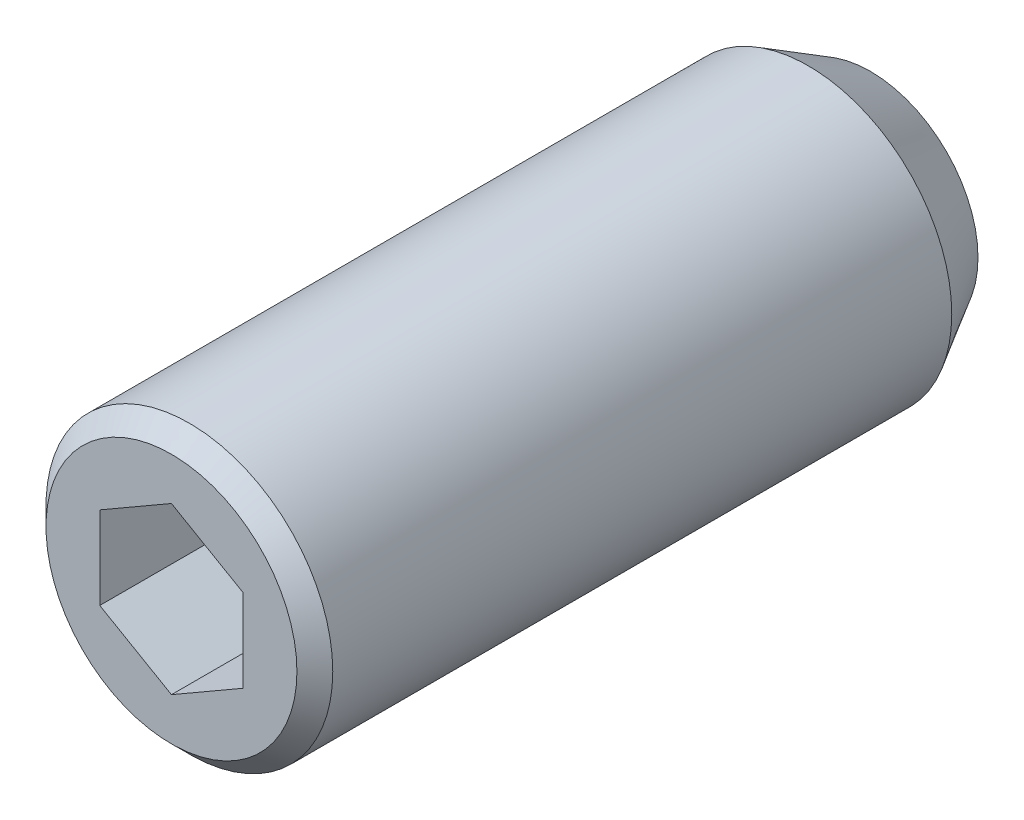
ISO-10303-21;
HEADER;
FILE_DESCRIPTION(('STEP AP214'),'2;1');
FILE_NAME('part.step','',(''),(''),'','','');
FILE_SCHEMA(('AUTOMOTIVE_DESIGN { 1 0 10303 214 1 1 1 1 }'));
ENDSEC;
DATA;
#1=APPLICATION_CONTEXT('core data for automotive mechanical design processes');
#2=APPLICATION_PROTOCOL_DEFINITION('international standard','automotive_design',2000,#1);
#3=PRODUCT_CONTEXT('',#1,'mechanical');
#4=PRODUCT('Part','Part','',(#3));
#5=PRODUCT_RELATED_PRODUCT_CATEGORY('part','',(#4));
#6=PRODUCT_DEFINITION_FORMATION('','',#4);
#7=PRODUCT_DEFINITION_CONTEXT('part definition',#1,'design');
#8=PRODUCT_DEFINITION('design','',#6,#7);
#9=PRODUCT_DEFINITION_SHAPE('','',#8);
#10=(LENGTH_UNIT() NAMED_UNIT(*) SI_UNIT(.MILLI.,.METRE.));
#11=(NAMED_UNIT(*) PLANE_ANGLE_UNIT() SI_UNIT($,.RADIAN.));
#12=(NAMED_UNIT(*) SI_UNIT($,.STERADIAN.) SOLID_ANGLE_UNIT());
#13=UNCERTAINTY_MEASURE_WITH_UNIT(LENGTH_MEASURE(1.E-05),#10,'distance_accuracy_value','');
#14=(GEOMETRIC_REPRESENTATION_CONTEXT(3) GLOBAL_UNCERTAINTY_ASSIGNED_CONTEXT((#13)) GLOBAL_UNIT_ASSIGNED_CONTEXT((#10,
#11,#12)) REPRESENTATION_CONTEXT('',''));
#15=CARTESIAN_POINT('',(0.,0.,0.));
#16=DIRECTION('',(0.,0.,1.));
#17=DIRECTION('',(1.,0.,0.));
#18=AXIS2_PLACEMENT_3D('',#15,#16,#17);
#19=CARTESIAN_POINT('',(1.,0.577350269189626,8.5));
#20=DIRECTION('',(0.5,0.866025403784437,0.));
#21=DIRECTION('',(0.866025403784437,-0.5,0.));
#22=AXIS2_PLACEMENT_3D('',#19,#20,#21);
#23=PLANE('',#22);
#24=DIRECTION('',(0.,0.,1.));
#25=VECTOR('',#24,1.);
#26=CARTESIAN_POINT('',(1.,0.577350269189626,8.5));
#27=LINE('',#26,#25);
#28=CARTESIAN_POINT('',(1.,0.577350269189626,8.5));
#29=VERTEX_POINT('',#28);
#30=CARTESIAN_POINT('',(1.,0.577350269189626,10.5));
#31=VERTEX_POINT('',#30);
#32=EDGE_CURVE('E96',#29,#31,#27,.T.);
#33=ORIENTED_EDGE('',*,*,#32,.T.);
#34=DIRECTION('',(-0.866025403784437,0.5,0.));
#35=VECTOR('',#34,1.);
#36=CARTESIAN_POINT('',(1.,0.577350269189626,10.5));
#37=LINE('',#36,#35);
#38=CARTESIAN_POINT('',(0.,1.15470053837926,10.5));
#39=VERTEX_POINT('',#38);
#40=EDGE_CURVE('E29',#31,#39,#37,.T.);
#41=ORIENTED_EDGE('',*,*,#40,.T.);
#42=DIRECTION('',(0.,0.,1.));
#43=VECTOR('',#42,1.);
#44=CARTESIAN_POINT('',(0.,1.15470053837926,8.5));
#45=LINE('',#44,#43);
#46=CARTESIAN_POINT('',(0.,1.15470053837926,8.5));
#47=VERTEX_POINT('',#46);
#48=EDGE_CURVE('E34',#47,#39,#45,.T.);
#49=ORIENTED_EDGE('',*,*,#48,.F.);
#50=DIRECTION('',(-0.866025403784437,0.5,0.));
#51=VECTOR('',#50,1.);
#52=CARTESIAN_POINT('',(1.,0.577350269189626,8.5));
#53=LINE('',#52,#51);
#54=EDGE_CURVE('E90',#29,#47,#53,.T.);
#55=ORIENTED_EDGE('',*,*,#54,.F.);
#56=EDGE_LOOP('',(#33,#41,#49,#55));
#57=FACE_BOUND('',#56,.T.);
#58=ADVANCED_FACE('F14',(#57),#23,.F.);
#59=CARTESIAN_POINT('',(1.,-0.577350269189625,8.5));
#60=DIRECTION('',(1.,0.,0.));
#61=DIRECTION('',(0.,-1.,0.));
#62=AXIS2_PLACEMENT_3D('',#59,#60,#61);
#63=PLANE('',#62);
#64=DIRECTION('',(0.,0.,1.));
#65=VECTOR('',#64,1.);
#66=CARTESIAN_POINT('',(1.,-0.577350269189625,8.5));
#67=LINE('',#66,#65);
#68=CARTESIAN_POINT('',(1.,-0.577350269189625,8.5));
#69=VERTEX_POINT('',#68);
#70=CARTESIAN_POINT('',(1.,-0.577350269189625,10.5));
#71=VERTEX_POINT('',#70);
#72=EDGE_CURVE('E93',#69,#71,#67,.T.);
#73=ORIENTED_EDGE('',*,*,#72,.T.);
#74=DIRECTION('',(0.,1.,0.));
#75=VECTOR('',#74,1.);
#76=CARTESIAN_POINT('',(1.,-0.577350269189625,10.5));
#77=LINE('',#76,#75);
#78=EDGE_CURVE('E156',#71,#31,#77,.T.);
#79=ORIENTED_EDGE('',*,*,#78,.T.);
#80=ORIENTED_EDGE('',*,*,#32,.F.);
#81=DIRECTION('',(0.,1.,0.));
#82=VECTOR('',#81,1.);
#83=CARTESIAN_POINT('',(1.,-0.577350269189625,8.5));
#84=LINE('',#83,#82);
#85=EDGE_CURVE('E85',#69,#29,#84,.T.);
#86=ORIENTED_EDGE('',*,*,#85,.F.);
#87=EDGE_LOOP('',(#73,#79,#80,#86));
#88=FACE_BOUND('',#87,.T.);
#89=ADVANCED_FACE('F122',(#88),#63,.F.);
#90=CARTESIAN_POINT('',(1.,-0.577350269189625,8.5));
#91=DIRECTION('',(-0.5,0.866025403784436,0.));
#92=DIRECTION('',(0.866025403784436,0.5,0.));
#93=AXIS2_PLACEMENT_3D('',#90,#91,#92);
#94=PLANE('',#93);
#95=DIRECTION('',(0.,0.,1.));
#96=VECTOR('',#95,1.);
#97=CARTESIAN_POINT('',(0.,-1.15470053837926,8.5));
#98=LINE('',#97,#96);
#99=CARTESIAN_POINT('',(0.,-1.15470053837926,8.5));
#100=VERTEX_POINT('',#99);
#101=CARTESIAN_POINT('',(0.,-1.15470053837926,10.5));
#102=VERTEX_POINT('',#101);
#103=EDGE_CURVE('E68',#100,#102,#98,.T.);
#104=ORIENTED_EDGE('',*,*,#103,.T.);
#105=DIRECTION('',(-0.866025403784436,-0.5,0.));
#106=VECTOR('',#105,1.);
#107=CARTESIAN_POINT('',(1.,-0.577350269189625,10.5));
#108=LINE('',#107,#106);
#109=EDGE_CURVE('E148',#71,#102,#108,.T.);
#110=ORIENTED_EDGE('',*,*,#109,.F.);
#111=ORIENTED_EDGE('',*,*,#72,.F.);
#112=DIRECTION('',(-0.866025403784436,-0.5,0.));
#113=VECTOR('',#112,1.);
#114=CARTESIAN_POINT('',(1.,-0.577350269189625,8.5));
#115=LINE('',#114,#113);
#116=EDGE_CURVE('E83',#69,#100,#115,.T.);
#117=ORIENTED_EDGE('',*,*,#116,.T.);
#118=EDGE_LOOP('',(#104,#110,#111,#117));
#119=FACE_BOUND('',#118,.T.);
#120=ADVANCED_FACE('F127',(#119),#94,.T.);
#121=CARTESIAN_POINT('',(-1.,-0.577350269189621,8.5));
#122=DIRECTION('',(-0.5,-0.866025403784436,0.));
#123=DIRECTION('',(-0.866025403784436,0.5,0.));
#124=AXIS2_PLACEMENT_3D('',#121,#122,#123);
#125=PLANE('',#124);
#126=DIRECTION('',(0.,0.,1.));
#127=VECTOR('',#126,1.);
#128=CARTESIAN_POINT('',(-1.,-0.577350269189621,8.5));
#129=LINE('',#128,#127);
#130=CARTESIAN_POINT('',(-1.,-0.577350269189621,8.5));
#131=VERTEX_POINT('',#130);
#132=CARTESIAN_POINT('',(-1.,-0.577350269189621,10.5));
#133=VERTEX_POINT('',#132);
#134=EDGE_CURVE('E56',#131,#133,#129,.T.);
#135=ORIENTED_EDGE('',*,*,#134,.T.);
#136=DIRECTION('',(0.866025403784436,-0.5,0.));
#137=VECTOR('',#136,1.);
#138=CARTESIAN_POINT('',(-1.,-0.577350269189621,10.5));
#139=LINE('',#138,#137);
#140=EDGE_CURVE('E151',#133,#102,#139,.T.);
#141=ORIENTED_EDGE('',*,*,#140,.T.);
#142=ORIENTED_EDGE('',*,*,#103,.F.);
#143=DIRECTION('',(0.866025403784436,-0.5,0.));
#144=VECTOR('',#143,1.);
#145=CARTESIAN_POINT('',(-1.,-0.577350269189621,8.5));
#146=LINE('',#145,#144);
#147=EDGE_CURVE('E76',#131,#100,#146,.T.);
#148=ORIENTED_EDGE('',*,*,#147,.F.);
#149=EDGE_LOOP('',(#135,#141,#142,#148));
#150=FACE_BOUND('',#149,.T.);
#151=ADVANCED_FACE('F81',(#150),#125,.F.);
#152=CARTESIAN_POINT('',(-1.,-0.577350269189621,8.5));
#153=DIRECTION('',(1.,0.,0.));
#154=DIRECTION('',(0.,-1.,0.));
#155=AXIS2_PLACEMENT_3D('',#152,#153,#154);
#156=PLANE('',#155);
#157=DIRECTION('',(0.,0.,1.));
#158=VECTOR('',#157,1.);
#159=CARTESIAN_POINT('',(-1.,0.577350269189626,8.5));
#160=LINE('',#159,#158);
#161=CARTESIAN_POINT('',(-1.,0.577350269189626,8.5));
#162=VERTEX_POINT('',#161);
#163=CARTESIAN_POINT('',(-1.,0.577350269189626,10.5));
#164=VERTEX_POINT('',#163);
#165=EDGE_CURVE('E69',#162,#164,#160,.T.);
#166=ORIENTED_EDGE('',*,*,#165,.T.);
#167=DIRECTION('',(0.,1.,0.));
#168=VECTOR('',#167,1.);
#169=CARTESIAN_POINT('',(-1.,-0.577350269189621,10.5));
#170=LINE('',#169,#168);
#171=EDGE_CURVE('E63',#133,#164,#170,.T.);
#172=ORIENTED_EDGE('',*,*,#171,.F.);
#173=ORIENTED_EDGE('',*,*,#134,.F.);
#174=DIRECTION('',(0.,1.,0.));
#175=VECTOR('',#174,1.);
#176=CARTESIAN_POINT('',(-1.,-0.577350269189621,8.5));
#177=LINE('',#176,#175);
#178=EDGE_CURVE('E60',#131,#162,#177,.T.);
#179=ORIENTED_EDGE('',*,*,#178,.T.);
#180=EDGE_LOOP('',(#166,#172,#173,#179));
#181=FACE_BOUND('',#180,.T.);
#182=ADVANCED_FACE('F59',(#181),#156,.T.);
#183=CARTESIAN_POINT('',(-1.,0.577350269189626,8.5));
#184=DIRECTION('',(0.5,-0.866025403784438,0.));
#185=DIRECTION('',(-0.866025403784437,-0.5,0.));
#186=AXIS2_PLACEMENT_3D('',#183,#184,#185);
#187=PLANE('',#186);
#188=DIRECTION('',(0.866025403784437,0.5,0.));
#189=VECTOR('',#188,1.);
#190=CARTESIAN_POINT('',(-1.,0.577350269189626,8.5));
#191=LINE('',#190,#189);
#192=EDGE_CURVE('E79',#162,#47,#191,.T.);
#193=ORIENTED_EDGE('',*,*,#192,.T.);
#194=ORIENTED_EDGE('',*,*,#48,.T.);
#195=DIRECTION('',(0.866025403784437,0.5,0.));
#196=VECTOR('',#195,1.);
#197=CARTESIAN_POINT('',(-1.,0.577350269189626,10.5));
#198=LINE('',#197,#196);
#199=EDGE_CURVE('E163',#164,#39,#198,.T.);
#200=ORIENTED_EDGE('',*,*,#199,.F.);
#201=ORIENTED_EDGE('',*,*,#165,.F.);
#202=EDGE_LOOP('',(#193,#194,#200,#201));
#203=FACE_BOUND('',#202,.T.);
#204=ADVANCED_FACE('F120',(#203),#187,.T.);
#205=CARTESIAN_POINT('',(2.,0.,8.5));
#206=DIRECTION('',(0.,0.,1.));
#207=DIRECTION('',(-1.,0.,0.));
#208=AXIS2_PLACEMENT_3D('',#205,#206,#207);
#209=PLANE('',#208);
#210=ORIENTED_EDGE('',*,*,#54,.T.);
#211=ORIENTED_EDGE('',*,*,#192,.F.);
#212=ORIENTED_EDGE('',*,*,#178,.F.);
#213=ORIENTED_EDGE('',*,*,#147,.T.);
#214=ORIENTED_EDGE('',*,*,#116,.F.);
#215=ORIENTED_EDGE('',*,*,#85,.T.);
#216=EDGE_LOOP('',(#210,#211,#212,#213,#214,#215));
#217=FACE_BOUND('',#216,.T.);
#218=ADVANCED_FACE('F74',(#217),#209,.T.);
#219=CARTESIAN_POINT('',(0.,0.,10.25));
#220=DIRECTION('',(0.,0.,-1.));
#221=DIRECTION('',(1.,0.,0.));
#222=AXIS2_PLACEMENT_3D('',#219,#220,#221);
#223=CYLINDRICAL_SURFACE('',#222,2.);
#224=CARTESIAN_POINT('',(0.,0.,10.25));
#225=DIRECTION('',(0.,0.,-1.));
#226=DIRECTION('',(1.,0.,0.));
#227=AXIS2_PLACEMENT_3D('',#224,#225,#226);
#228=CIRCLE('',#227,2.);
#229=CARTESIAN_POINT('',(2.,0.,10.25));
#230=VERTEX_POINT('',#229);
#231=EDGE_CURVE('E22',#230,#230,#228,.T.);
#232=ORIENTED_EDGE('',*,*,#231,.T.);
#233=EDGE_LOOP('',(#232));
#234=FACE_BOUND('',#233,.T.);
#235=CARTESIAN_POINT('',(0.,0.,1.61602540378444));
#236=DIRECTION('',(0.,0.,-1.));
#237=DIRECTION('',(-1.,0.,0.));
#238=AXIS2_PLACEMENT_3D('',#235,#236,#237);
#239=CIRCLE('',#238,2.);
#240=CARTESIAN_POINT('',(-2.,0.,1.61602540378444));
#241=VERTEX_POINT('',#240);
#242=EDGE_CURVE('E175',#241,#241,#239,.T.);
#243=ORIENTED_EDGE('',*,*,#242,.F.);
#244=EDGE_LOOP('',(#243));
#245=FACE_BOUND('',#244,.T.);
#246=ADVANCED_FACE('F103',(#234,#245),#223,.T.);
#247=CARTESIAN_POINT('',(0.,0.,10.25));
#248=DIRECTION('',(0.,0.,-1.));
#249=DIRECTION('',(1.,0.,0.));
#250=AXIS2_PLACEMENT_3D('',#247,#248,#249);
#251=CONICAL_SURFACE('',#250,2.,0.785398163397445);
#252=CARTESIAN_POINT('',(0.,0.,10.5));
#253=DIRECTION('',(0.,0.,-1.));
#254=DIRECTION('',(1.,0.,0.));
#255=AXIS2_PLACEMENT_3D('',#252,#253,#254);
#256=CIRCLE('',#255,1.75);
#257=CARTESIAN_POINT('',(1.75,0.,10.5));
#258=VERTEX_POINT('',#257);
#259=EDGE_CURVE('E98',#258,#258,#256,.T.);
#260=ORIENTED_EDGE('',*,*,#259,.T.);
#261=EDGE_LOOP('',(#260));
#262=FACE_BOUND('',#261,.T.);
#263=ORIENTED_EDGE('',*,*,#231,.F.);
#264=EDGE_LOOP('',(#263));
#265=FACE_BOUND('',#264,.T.);
#266=ADVANCED_FACE('F106',(#262,#265),#251,.T.);
#267=CARTESIAN_POINT('',(0.,0.,10.5));
#268=DIRECTION('',(0.,0.,-1.));
#269=DIRECTION('',(1.,0.,0.));
#270=AXIS2_PLACEMENT_3D('',#267,#268,#269);
#271=PLANE('',#270);
#272=ORIENTED_EDGE('',*,*,#199,.T.);
#273=ORIENTED_EDGE('',*,*,#40,.F.);
#274=ORIENTED_EDGE('',*,*,#78,.F.);
#275=ORIENTED_EDGE('',*,*,#109,.T.);
#276=ORIENTED_EDGE('',*,*,#140,.F.);
#277=ORIENTED_EDGE('',*,*,#171,.T.);
#278=EDGE_LOOP('',(#272,#273,#274,#275,#276,#277));
#279=FACE_BOUND('',#278,.T.);
#280=ORIENTED_EDGE('',*,*,#259,.F.);
#281=EDGE_LOOP('',(#280));
#282=FACE_BOUND('',#281,.T.);
#283=ADVANCED_FACE('F108',(#279,#282),#271,.F.);
#284=CARTESIAN_POINT('',(0.,0.,0.75));
#285=DIRECTION('',(0.,0.,1.));
#286=DIRECTION('',(1.,0.,0.));
#287=AXIS2_PLACEMENT_3D('',#284,#285,#286);
#288=CONICAL_SURFACE('',#287,1.5,0.523598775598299);
#289=ORIENTED_EDGE('',*,*,#242,.T.);
#290=EDGE_LOOP('',(#289));
#291=FACE_BOUND('',#290,.T.);
#292=CARTESIAN_POINT('',(0.,0.,0.75));
#293=DIRECTION('',(0.,0.,-1.));
#294=DIRECTION('',(-1.,0.,0.));
#295=AXIS2_PLACEMENT_3D('',#292,#293,#294);
#296=CIRCLE('',#295,1.5);
#297=CARTESIAN_POINT('',(-1.5,0.,0.75));
#298=VERTEX_POINT('',#297);
#299=EDGE_CURVE('E158',#298,#298,#296,.T.);
#300=ORIENTED_EDGE('',*,*,#299,.F.);
#301=EDGE_LOOP('',(#300));
#302=FACE_BOUND('',#301,.T.);
#303=ADVANCED_FACE('F116',(#291,#302),#288,.T.);
#304=CARTESIAN_POINT('',(0.,0.,1.25));
#305=DIRECTION('',(0.,0.,-1.));
#306=DIRECTION('',(1.,0.,0.));
#307=AXIS2_PLACEMENT_3D('',#304,#305,#306);
#308=SPHERICAL_SURFACE('',#307,1.25);
#309=CARTESIAN_POINT('',(0.,0.,0.75));
#310=DIRECTION('',(0.,0.,-1.));
#311=DIRECTION('',(1.,0.,0.));
#312=AXIS2_PLACEMENT_3D('',#309,#310,#311);
#313=CIRCLE('',#312,1.14564392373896);
#314=CARTESIAN_POINT('',(1.14564392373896,0.,0.75));
#315=VERTEX_POINT('',#314);
#316=EDGE_CURVE('E9',#315,#315,#313,.T.);
#317=ORIENTED_EDGE('',*,*,#316,.T.);
#318=EDGE_LOOP('',(#317));
#319=FACE_BOUND('',#318,.T.);
#320=ADVANCED_FACE('F16',(#319),#308,.T.);
#321=CARTESIAN_POINT('',(1.42264973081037,0.,0.75));
#322=DIRECTION('',(0.,0.,1.));
#323=DIRECTION('',(-1.,0.,0.));
#324=AXIS2_PLACEMENT_3D('',#321,#322,#323);
#325=PLANE('',#324);
#326=ORIENTED_EDGE('',*,*,#316,.F.);
#327=EDGE_LOOP('',(#326));
#328=FACE_BOUND('',#327,.T.);
#329=ORIENTED_EDGE('',*,*,#299,.T.);
#330=EDGE_LOOP('',(#329));
#331=FACE_BOUND('',#330,.T.);
#332=ADVANCED_FACE('F183',(#328,#331),#325,.F.);
#333=CLOSED_SHELL('',(#58,#89,#120,#151,#182,#204,#218,#246,#266,#283,#303,#320,#332));
#334=MANIFOLD_SOLID_BREP('B1',#333);
#335=ADVANCED_BREP_SHAPE_REPRESENTATION('',(#18,#334),#14);
#336=SHAPE_DEFINITION_REPRESENTATION(#9,#335);
ENDSEC;
END-ISO-10303-21;
